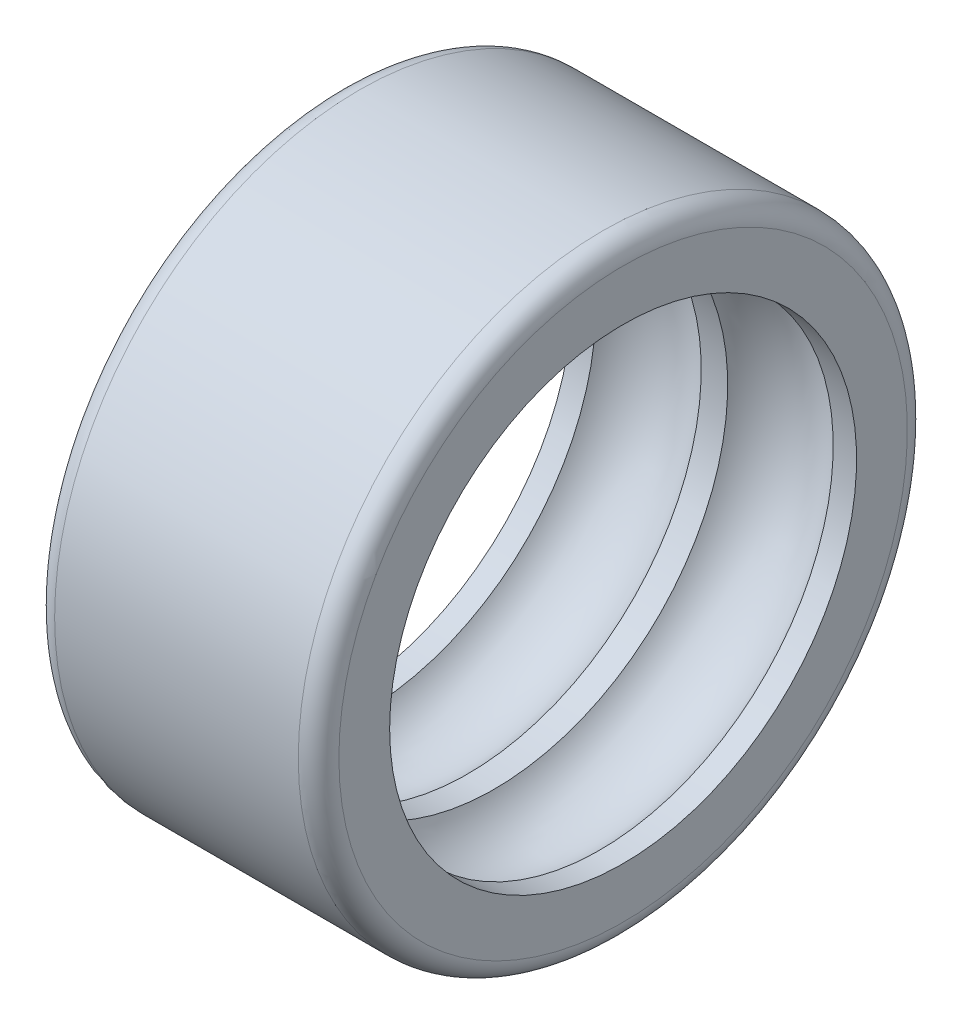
ISO-10303-21;
HEADER;
FILE_DESCRIPTION(('STEP AP214'),'2;1');
FILE_NAME('part.step','',(''),(''),'','','');
FILE_SCHEMA(('AUTOMOTIVE_DESIGN { 1 0 10303 214 1 1 1 1 }'));
ENDSEC;
DATA;
#1=APPLICATION_CONTEXT('core data for automotive mechanical design processes');
#2=APPLICATION_PROTOCOL_DEFINITION('international standard','automotive_design',2000,#1);
#3=PRODUCT_CONTEXT('',#1,'mechanical');
#4=PRODUCT('Part','Part','',(#3));
#5=PRODUCT_RELATED_PRODUCT_CATEGORY('part','',(#4));
#6=PRODUCT_DEFINITION_FORMATION('','',#4);
#7=PRODUCT_DEFINITION_CONTEXT('part definition',#1,'design');
#8=PRODUCT_DEFINITION('design','',#6,#7);
#9=PRODUCT_DEFINITION_SHAPE('','',#8);
#10=(LENGTH_UNIT() NAMED_UNIT(*) SI_UNIT(.MILLI.,.METRE.));
#11=(NAMED_UNIT(*) PLANE_ANGLE_UNIT() SI_UNIT($,.RADIAN.));
#12=(NAMED_UNIT(*) SI_UNIT($,.STERADIAN.) SOLID_ANGLE_UNIT());
#13=UNCERTAINTY_MEASURE_WITH_UNIT(LENGTH_MEASURE(1.E-05),#10,'distance_accuracy_value','');
#14=(GEOMETRIC_REPRESENTATION_CONTEXT(3) GLOBAL_UNCERTAINTY_ASSIGNED_CONTEXT((#13)) GLOBAL_UNIT_ASSIGNED_CONTEXT((#10,
#11,#12)) REPRESENTATION_CONTEXT('',''));
#15=CARTESIAN_POINT('',(0.,0.,0.));
#16=DIRECTION('',(0.,0.,1.));
#17=DIRECTION('',(1.,0.,0.));
#18=AXIS2_PLACEMENT_3D('',#15,#16,#17);
#19=CARTESIAN_POINT('',(0.,0.,0.));
#20=DIRECTION('',(-1.,0.,0.));
#21=DIRECTION('',(0.,0.,1.));
#22=AXIS2_PLACEMENT_3D('',#19,#20,#21);
#23=CYLINDRICAL_SURFACE('',#22,11.5);
#24=CARTESIAN_POINT('',(1.15192378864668,0.,0.));
#25=DIRECTION('',(-1.,0.,0.));
#26=DIRECTION('',(0.,0.,1.));
#27=AXIS2_PLACEMENT_3D('',#24,#25,#26);
#28=CIRCLE('',#27,11.5);
#29=CARTESIAN_POINT('',(1.15192378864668,0.,11.5));
#30=VERTEX_POINT('',#29);
#31=EDGE_CURVE('E55',#30,#30,#28,.T.);
#32=ORIENTED_EDGE('',*,*,#31,.F.);
#33=EDGE_LOOP('',(#32));
#34=FACE_BOUND('',#33,.T.);
#35=CARTESIAN_POINT('',(0.,0.,0.));
#36=DIRECTION('',(-1.,0.,0.));
#37=DIRECTION('',(0.,0.,1.));
#38=AXIS2_PLACEMENT_3D('',#35,#36,#37);
#39=CIRCLE('',#38,11.5);
#40=CARTESIAN_POINT('',(0.,0.,11.5));
#41=VERTEX_POINT('',#40);
#42=EDGE_CURVE('E70',#41,#41,#39,.T.);
#43=ORIENTED_EDGE('',*,*,#42,.T.);
#44=EDGE_LOOP('',(#43));
#45=FACE_BOUND('',#44,.T.);
#46=ADVANCED_FACE('F32',(#34,#45),#23,.F.);
#47=CARTESIAN_POINT('',(3.75,0.,0.));
#48=DIRECTION('',(-1.,0.,0.));
#49=DIRECTION('',(0.,0.,1.));
#50=AXIS2_PLACEMENT_3D('',#47,#48,#49);
#51=TOROIDAL_SURFACE('',#50,10.,3.);
#52=CARTESIAN_POINT('',(6.34807621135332,0.,0.));
#53=DIRECTION('',(-1.,0.,0.));
#54=DIRECTION('',(0.,0.,1.));
#55=AXIS2_PLACEMENT_3D('',#52,#53,#54);
#56=CIRCLE('',#55,11.5);
#57=CARTESIAN_POINT('',(6.34807621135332,0.,11.5));
#58=VERTEX_POINT('',#57);
#59=EDGE_CURVE('E58',#58,#58,#56,.T.);
#60=ORIENTED_EDGE('',*,*,#59,.F.);
#61=EDGE_LOOP('',(#60));
#62=FACE_BOUND('',#61,.T.);
#63=ORIENTED_EDGE('',*,*,#31,.T.);
#64=EDGE_LOOP('',(#63));
#65=FACE_BOUND('',#64,.T.);
#66=ADVANCED_FACE('F91',(#62,#65),#51,.F.);
#67=CARTESIAN_POINT('',(0.,0.,0.));
#68=DIRECTION('',(-1.,0.,0.));
#69=DIRECTION('',(0.,0.,1.));
#70=AXIS2_PLACEMENT_3D('',#67,#68,#69);
#71=CYLINDRICAL_SURFACE('',#70,11.5);
#72=CARTESIAN_POINT('',(7.65192378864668,0.,0.));
#73=DIRECTION('',(-1.,0.,0.));
#74=DIRECTION('',(0.,0.,1.));
#75=AXIS2_PLACEMENT_3D('',#72,#73,#74);
#76=CIRCLE('',#75,11.5);
#77=CARTESIAN_POINT('',(7.65192378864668,0.,11.5));
#78=VERTEX_POINT('',#77);
#79=EDGE_CURVE('E61',#78,#78,#76,.T.);
#80=ORIENTED_EDGE('',*,*,#79,.F.);
#81=EDGE_LOOP('',(#80));
#82=FACE_BOUND('',#81,.T.);
#83=ORIENTED_EDGE('',*,*,#59,.T.);
#84=EDGE_LOOP('',(#83));
#85=FACE_BOUND('',#84,.T.);
#86=ADVANCED_FACE('F96',(#82,#85),#71,.F.);
#87=CARTESIAN_POINT('',(10.25,0.,0.));
#88=DIRECTION('',(-1.,0.,0.));
#89=DIRECTION('',(0.,0.,1.));
#90=AXIS2_PLACEMENT_3D('',#87,#88,#89);
#91=TOROIDAL_SURFACE('',#90,10.,3.);
#92=CARTESIAN_POINT('',(12.8480762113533,0.,0.));
#93=DIRECTION('',(-1.,0.,0.));
#94=DIRECTION('',(0.,0.,1.));
#95=AXIS2_PLACEMENT_3D('',#92,#93,#94);
#96=CIRCLE('',#95,11.5);
#97=CARTESIAN_POINT('',(12.8480762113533,0.,11.5));
#98=VERTEX_POINT('',#97);
#99=EDGE_CURVE('E64',#98,#98,#96,.T.);
#100=ORIENTED_EDGE('',*,*,#99,.F.);
#101=EDGE_LOOP('',(#100));
#102=FACE_BOUND('',#101,.T.);
#103=ORIENTED_EDGE('',*,*,#79,.T.);
#104=EDGE_LOOP('',(#103));
#105=FACE_BOUND('',#104,.T.);
#106=ADVANCED_FACE('F103',(#102,#105),#91,.F.);
#107=CARTESIAN_POINT('',(0.,0.,0.));
#108=DIRECTION('',(-1.,0.,0.));
#109=DIRECTION('',(0.,0.,1.));
#110=AXIS2_PLACEMENT_3D('',#107,#108,#109);
#111=CYLINDRICAL_SURFACE('',#110,11.5);
#112=CARTESIAN_POINT('',(14.,0.,0.));
#113=DIRECTION('',(-1.,0.,0.));
#114=DIRECTION('',(0.,0.,1.));
#115=AXIS2_PLACEMENT_3D('',#112,#113,#114);
#116=CIRCLE('',#115,11.5);
#117=CARTESIAN_POINT('',(14.,0.,11.5));
#118=VERTEX_POINT('',#117);
#119=EDGE_CURVE('E67',#118,#118,#116,.T.);
#120=ORIENTED_EDGE('',*,*,#119,.F.);
#121=EDGE_LOOP('',(#120));
#122=FACE_BOUND('',#121,.T.);
#123=ORIENTED_EDGE('',*,*,#99,.T.);
#124=EDGE_LOOP('',(#123));
#125=FACE_BOUND('',#124,.T.);
#126=ADVANCED_FACE('F110',(#122,#125),#111,.F.);
#127=CARTESIAN_POINT('',(14.,15.,0.));
#128=DIRECTION('',(-1.,0.,0.));
#129=DIRECTION('',(0.,0.,1.));
#130=AXIS2_PLACEMENT_3D('',#127,#128,#129);
#131=PLANE('',#130);
#132=CARTESIAN_POINT('',(14.,0.,0.));
#133=DIRECTION('',(-1.,0.,0.));
#134=DIRECTION('',(0.,0.,1.));
#135=AXIS2_PLACEMENT_3D('',#132,#133,#134);
#136=CIRCLE('',#135,14.);
#137=CARTESIAN_POINT('',(14.,0.,14.));
#138=VERTEX_POINT('',#137);
#139=EDGE_CURVE('E39',#138,#138,#136,.F.);
#140=ORIENTED_EDGE('',*,*,#139,.T.);
#141=EDGE_LOOP('',(#140));
#142=FACE_BOUND('',#141,.T.);
#143=ORIENTED_EDGE('',*,*,#119,.T.);
#144=EDGE_LOOP('',(#143));
#145=FACE_BOUND('',#144,.T.);
#146=ADVANCED_FACE('F87',(#142,#145),#131,.F.);
#147=CARTESIAN_POINT('',(0.,0.,0.));
#148=DIRECTION('',(-1.,0.,0.));
#149=DIRECTION('',(0.,0.,1.));
#150=AXIS2_PLACEMENT_3D('',#147,#148,#149);
#151=CYLINDRICAL_SURFACE('',#150,15.);
#152=CARTESIAN_POINT('',(13.,0.,0.));
#153=DIRECTION('',(-1.,0.,0.));
#154=DIRECTION('',(0.,0.,1.));
#155=AXIS2_PLACEMENT_3D('',#152,#153,#154);
#156=CIRCLE('',#155,15.);
#157=CARTESIAN_POINT('',(13.,0.,15.));
#158=VERTEX_POINT('',#157);
#159=EDGE_CURVE('E46',#158,#158,#156,.T.);
#160=ORIENTED_EDGE('',*,*,#159,.T.);
#161=EDGE_LOOP('',(#160));
#162=FACE_BOUND('',#161,.T.);
#163=CARTESIAN_POINT('',(1.,0.,0.));
#164=DIRECTION('',(1.,0.,0.));
#165=DIRECTION('',(0.,0.,-1.));
#166=AXIS2_PLACEMENT_3D('',#163,#164,#165);
#167=CIRCLE('',#166,15.);
#168=CARTESIAN_POINT('',(1.,0.,-15.));
#169=VERTEX_POINT('',#168);
#170=EDGE_CURVE('E50',#169,#169,#167,.T.);
#171=ORIENTED_EDGE('',*,*,#170,.T.);
#172=EDGE_LOOP('',(#171));
#173=FACE_BOUND('',#172,.T.);
#174=ADVANCED_FACE('F78',(#162,#173),#151,.T.);
#175=CARTESIAN_POINT('',(0.,11.5,0.));
#176=DIRECTION('',(1.,0.,0.));
#177=DIRECTION('',(0.,0.,-1.));
#178=AXIS2_PLACEMENT_3D('',#175,#176,#177);
#179=PLANE('',#178);
#180=CARTESIAN_POINT('',(0.,0.,0.));
#181=DIRECTION('',(1.,0.,0.));
#182=DIRECTION('',(0.,0.,-1.));
#183=AXIS2_PLACEMENT_3D('',#180,#181,#182);
#184=CIRCLE('',#183,14.);
#185=CARTESIAN_POINT('',(0.,0.,-14.));
#186=VERTEX_POINT('',#185);
#187=EDGE_CURVE('E10',#186,#186,#184,.F.);
#188=ORIENTED_EDGE('',*,*,#187,.T.);
#189=EDGE_LOOP('',(#188));
#190=FACE_BOUND('',#189,.T.);
#191=ORIENTED_EDGE('',*,*,#42,.F.);
#192=EDGE_LOOP('',(#191));
#193=FACE_BOUND('',#192,.T.);
#194=ADVANCED_FACE('F75',(#190,#193),#179,.F.);
#195=CARTESIAN_POINT('',(13.,0.,0.));
#196=DIRECTION('',(-1.,0.,0.));
#197=DIRECTION('',(0.,0.,1.));
#198=AXIS2_PLACEMENT_3D('',#195,#196,#197);
#199=TOROIDAL_SURFACE('',#198,14.,1.);
#200=ORIENTED_EDGE('',*,*,#139,.F.);
#201=EDGE_LOOP('',(#200));
#202=FACE_BOUND('',#201,.T.);
#203=ORIENTED_EDGE('',*,*,#159,.F.);
#204=EDGE_LOOP('',(#203));
#205=FACE_BOUND('',#204,.T.);
#206=ADVANCED_FACE('F77',(#202,#205),#199,.T.);
#207=CARTESIAN_POINT('',(1.,0.,0.));
#208=DIRECTION('',(1.,0.,0.));
#209=DIRECTION('',(0.,0.,-1.));
#210=AXIS2_PLACEMENT_3D('',#207,#208,#209);
#211=TOROIDAL_SURFACE('',#210,14.,1.);
#212=ORIENTED_EDGE('',*,*,#170,.F.);
#213=EDGE_LOOP('',(#212));
#214=FACE_BOUND('',#213,.T.);
#215=ORIENTED_EDGE('',*,*,#187,.F.);
#216=EDGE_LOOP('',(#215));
#217=FACE_BOUND('',#216,.T.);
#218=ADVANCED_FACE('F84',(#214,#217),#211,.T.);
#219=CLOSED_SHELL('',(#46,#66,#86,#106,#126,#146,#174,#194,#206,#218));
#220=MANIFOLD_SOLID_BREP('B2',#219);
#221=ADVANCED_BREP_SHAPE_REPRESENTATION('',(#18,#220),#14);
#222=SHAPE_DEFINITION_REPRESENTATION(#9,#221);
ENDSEC;
END-ISO-10303-21;
